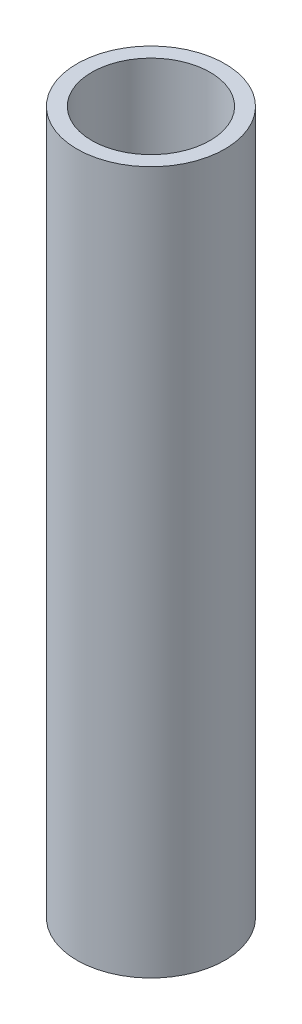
ISO-10303-21;
HEADER;
FILE_DESCRIPTION(('STEP AP214'),'2;1');
FILE_NAME('part.step','',(''),(''),'','','');
FILE_SCHEMA(('AUTOMOTIVE_DESIGN { 1 0 10303 214 1 1 1 1 }'));
ENDSEC;
DATA;
#1=APPLICATION_CONTEXT('core data for automotive mechanical design processes');
#2=APPLICATION_PROTOCOL_DEFINITION('international standard','automotive_design',2000,#1);
#3=PRODUCT_CONTEXT('',#1,'mechanical');
#4=PRODUCT('Part','Part','',(#3));
#5=PRODUCT_RELATED_PRODUCT_CATEGORY('part','',(#4));
#6=PRODUCT_DEFINITION_FORMATION('','',#4);
#7=PRODUCT_DEFINITION_CONTEXT('part definition',#1,'design');
#8=PRODUCT_DEFINITION('design','',#6,#7);
#9=PRODUCT_DEFINITION_SHAPE('','',#8);
#10=(LENGTH_UNIT() NAMED_UNIT(*) SI_UNIT(.MILLI.,.METRE.));
#11=(NAMED_UNIT(*) PLANE_ANGLE_UNIT() SI_UNIT($,.RADIAN.));
#12=(NAMED_UNIT(*) SI_UNIT($,.STERADIAN.) SOLID_ANGLE_UNIT());
#13=UNCERTAINTY_MEASURE_WITH_UNIT(LENGTH_MEASURE(1.E-05),#10,'distance_accuracy_value','');
#14=(GEOMETRIC_REPRESENTATION_CONTEXT(3) GLOBAL_UNCERTAINTY_ASSIGNED_CONTEXT((#13)) GLOBAL_UNIT_ASSIGNED_CONTEXT((#10,
#11,#12)) REPRESENTATION_CONTEXT('',''));
#15=CARTESIAN_POINT('',(0.,0.,0.));
#16=DIRECTION('',(0.,0.,1.));
#17=DIRECTION('',(1.,0.,0.));
#18=AXIS2_PLACEMENT_3D('',#15,#16,#17);
#19=CARTESIAN_POINT('',(0.,95.,0.));
#20=DIRECTION('',(0.,1.,0.));
#21=DIRECTION('',(0.,0.,1.));
#22=AXIS2_PLACEMENT_3D('',#19,#20,#21);
#23=PLANE('',#22);
#24=CARTESIAN_POINT('',(0.,95.,0.));
#25=DIRECTION('',(0.,1.,0.));
#26=DIRECTION('',(0.,0.,1.));
#27=AXIS2_PLACEMENT_3D('',#24,#25,#26);
#28=CIRCLE('',#27,10.);
#29=CARTESIAN_POINT('',(0.,95.,10.));
#30=VERTEX_POINT('',#29);
#31=EDGE_CURVE('E10',#30,#30,#28,.T.);
#32=ORIENTED_EDGE('',*,*,#31,.T.);
#33=EDGE_LOOP('',(#32));
#34=FACE_BOUND('',#33,.T.);
#35=CARTESIAN_POINT('',(0.,95.,0.));
#36=DIRECTION('',(0.,1.,0.));
#37=DIRECTION('',(0.,0.,1.));
#38=AXIS2_PLACEMENT_3D('',#35,#36,#37);
#39=CIRCLE('',#38,8.00000000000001);
#40=CARTESIAN_POINT('',(0.,95.,8.00000000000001));
#41=VERTEX_POINT('',#40);
#42=EDGE_CURVE('E51',#41,#41,#39,.T.);
#43=ORIENTED_EDGE('',*,*,#42,.F.);
#44=EDGE_LOOP('',(#43));
#45=FACE_BOUND('',#44,.T.);
#46=ADVANCED_FACE('F37',(#34,#45),#23,.T.);
#47=CARTESIAN_POINT('',(0.,0.,0.));
#48=DIRECTION('',(0.,1.,0.));
#49=DIRECTION('',(0.,0.,1.));
#50=AXIS2_PLACEMENT_3D('',#47,#48,#49);
#51=PLANE('',#50);
#52=CARTESIAN_POINT('',(0.,0.,0.));
#53=DIRECTION('',(0.,1.,0.));
#54=DIRECTION('',(0.,0.,1.));
#55=AXIS2_PLACEMENT_3D('',#52,#53,#54);
#56=CIRCLE('',#55,10.);
#57=CARTESIAN_POINT('',(0.,0.,10.));
#58=VERTEX_POINT('',#57);
#59=EDGE_CURVE('E41',#58,#58,#56,.T.);
#60=ORIENTED_EDGE('',*,*,#59,.F.);
#61=EDGE_LOOP('',(#60));
#62=FACE_BOUND('',#61,.T.);
#63=CARTESIAN_POINT('',(0.,0.,0.));
#64=DIRECTION('',(0.,1.,0.));
#65=DIRECTION('',(0.,0.,1.));
#66=AXIS2_PLACEMENT_3D('',#63,#64,#65);
#67=CIRCLE('',#66,8.00000000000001);
#68=CARTESIAN_POINT('',(0.,0.,8.00000000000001));
#69=VERTEX_POINT('',#68);
#70=EDGE_CURVE('E53',#69,#69,#67,.T.);
#71=ORIENTED_EDGE('',*,*,#70,.T.);
#72=EDGE_LOOP('',(#71));
#73=FACE_BOUND('',#72,.T.);
#74=ADVANCED_FACE('F66',(#62,#73),#51,.F.);
#75=CARTESIAN_POINT('',(0.,95.,0.));
#76=DIRECTION('',(0.,-1.,0.));
#77=DIRECTION('',(0.,0.,-1.));
#78=AXIS2_PLACEMENT_3D('',#75,#76,#77);
#79=CYLINDRICAL_SURFACE('',#78,10.);
#80=ORIENTED_EDGE('',*,*,#31,.F.);
#81=EDGE_LOOP('',(#80));
#82=FACE_BOUND('',#81,.T.);
#83=ORIENTED_EDGE('',*,*,#59,.T.);
#84=EDGE_LOOP('',(#83));
#85=FACE_BOUND('',#84,.T.);
#86=ADVANCED_FACE('F39',(#82,#85),#79,.T.);
#87=CARTESIAN_POINT('',(0.,95.,0.));
#88=DIRECTION('',(0.,-1.,0.));
#89=DIRECTION('',(0.,0.,-1.));
#90=AXIS2_PLACEMENT_3D('',#87,#88,#89);
#91=CYLINDRICAL_SURFACE('',#90,8.00000000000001);
#92=ORIENTED_EDGE('',*,*,#42,.T.);
#93=EDGE_LOOP('',(#92));
#94=FACE_BOUND('',#93,.T.);
#95=ORIENTED_EDGE('',*,*,#70,.F.);
#96=EDGE_LOOP('',(#95));
#97=FACE_BOUND('',#96,.T.);
#98=ADVANCED_FACE('F62',(#94,#97),#91,.F.);
#99=CLOSED_SHELL('',(#46,#74,#86,#98));
#100=MANIFOLD_SOLID_BREP('B2',#99);
#101=ADVANCED_BREP_SHAPE_REPRESENTATION('',(#18,#100),#14);
#102=SHAPE_DEFINITION_REPRESENTATION(#9,#101);
ENDSEC;
END-ISO-10303-21;
